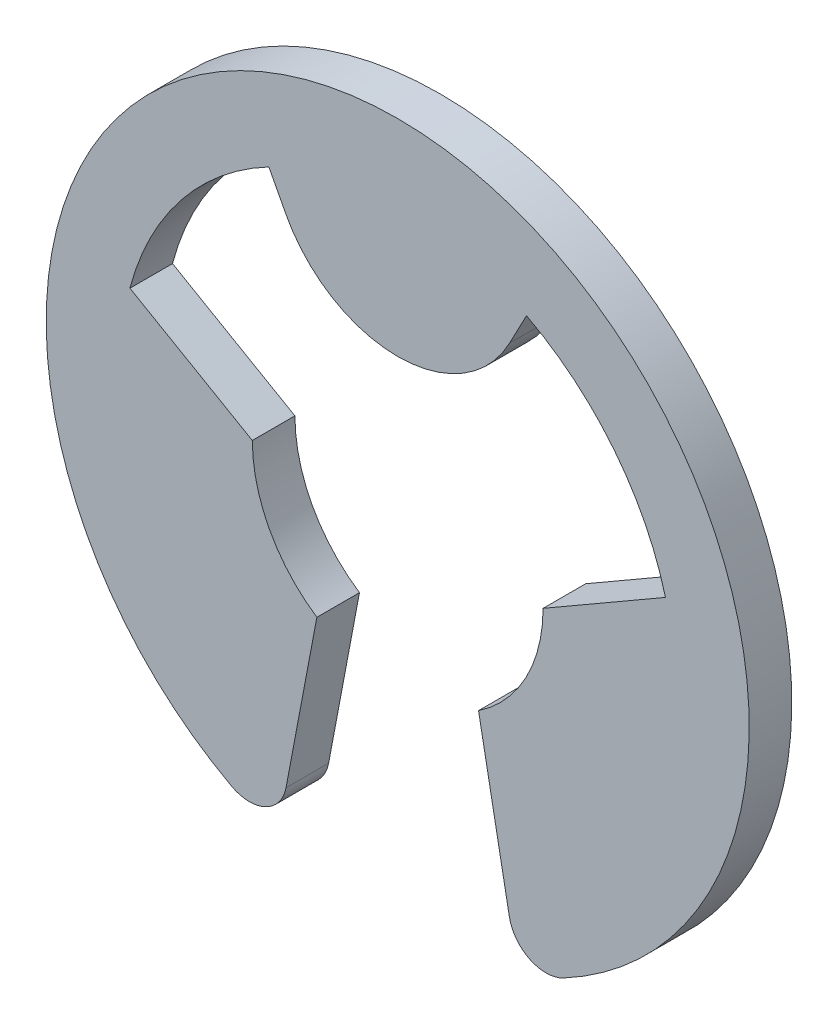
from build123d import *

# Parameters (mm, degrees)
EXTRUSION1_DEPTH = 0.4


with BuildPart() as part:
    # Esquisse1 → Extrusion1 (new body)
    with BuildSketch(Plane.XY):
        with BuildLine():
            Line((1.050752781, 1.999883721), (1.209302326, 2.301648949))
            ThreePointArc((1.209302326, 2.301648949), (2.033879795, 1.619670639), (2.513954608, 0.663349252))
            Line((2.513954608, 0.663349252), (1.365, 0))
            ThreePointArc((1.365, 0), (1.203980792, -0.643160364), (0.758911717, -1.134582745))
            Line((0.758911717, -1.134582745), (1.048407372, -2.665782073))
            ThreePointArc((1.048407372, -2.665782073), (1.241273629, -2.916493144), (1.557504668, -2.909326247))
            ThreePointArc((1.557504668, -2.909326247), (0, 3.3), (-1.557504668, -2.909326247))
            ThreePointArc((-1.557504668, -2.909326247), (-1.241273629, -2.916493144), (-1.048407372, -2.665782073))
            Line((-1.048407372, -2.665782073), (-0.758911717, -1.134582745))
            ThreePointArc((-0.758911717, -1.134582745), (-1.203980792, -0.643160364), (-1.365, 0))
            Line((-1.365, 0), (-2.513954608, 0.663349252))
            ThreePointArc((-2.513954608, 0.663349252), (-2.033879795, 1.619670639), (-1.209302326, 2.301648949))
            Line((-1.209302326, 2.301648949), (-1.050752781, 1.999883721))
            ThreePointArc((-1.050752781, 1.999883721), (0, 1.365), (1.050752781, 1.999883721))
        make_face()
    extrude(amount=EXTRUSION1_DEPTH)


solid = part.part
